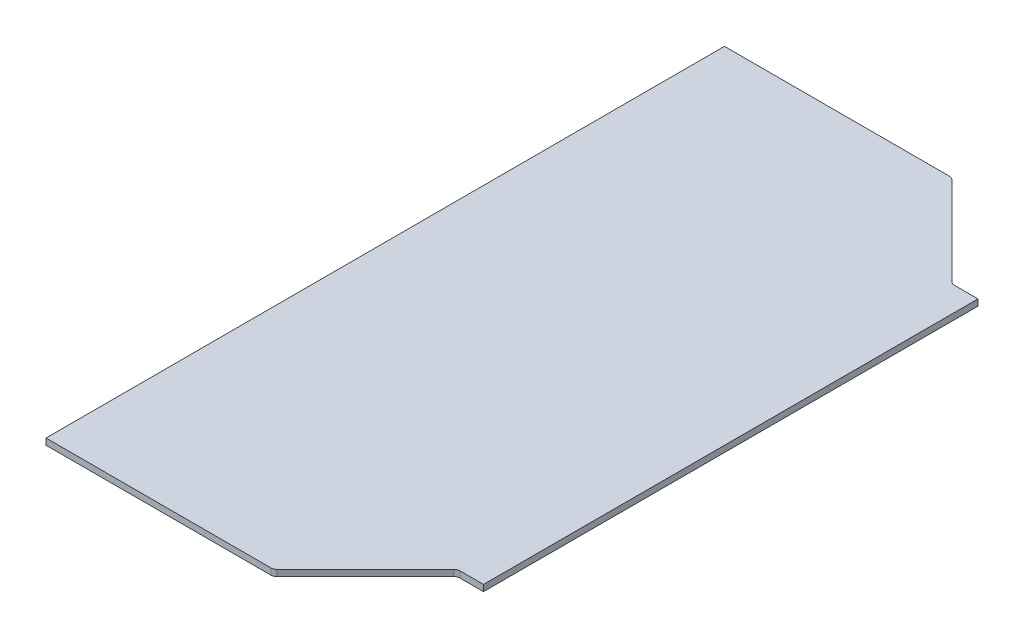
ISO-10303-21;
HEADER;
FILE_DESCRIPTION(('STEP AP214'),'2;1');
FILE_NAME('part.step','',(''),(''),'','','');
FILE_SCHEMA(('AUTOMOTIVE_DESIGN { 1 0 10303 214 1 1 1 1 }'));
ENDSEC;
DATA;
#1=APPLICATION_CONTEXT('core data for automotive mechanical design processes');
#2=APPLICATION_PROTOCOL_DEFINITION('international standard','automotive_design',2000,#1);
#3=PRODUCT_CONTEXT('',#1,'mechanical');
#4=PRODUCT('Part','Part','',(#3));
#5=PRODUCT_RELATED_PRODUCT_CATEGORY('part','',(#4));
#6=PRODUCT_DEFINITION_FORMATION('','',#4);
#7=PRODUCT_DEFINITION_CONTEXT('part definition',#1,'design');
#8=PRODUCT_DEFINITION('design','',#6,#7);
#9=PRODUCT_DEFINITION_SHAPE('','',#8);
#10=(LENGTH_UNIT() NAMED_UNIT(*) SI_UNIT(.MILLI.,.METRE.));
#11=(NAMED_UNIT(*) PLANE_ANGLE_UNIT() SI_UNIT($,.RADIAN.));
#12=(NAMED_UNIT(*) SI_UNIT($,.STERADIAN.) SOLID_ANGLE_UNIT());
#13=UNCERTAINTY_MEASURE_WITH_UNIT(LENGTH_MEASURE(1.E-05),#10,'distance_accuracy_value','');
#14=(GEOMETRIC_REPRESENTATION_CONTEXT(3) GLOBAL_UNCERTAINTY_ASSIGNED_CONTEXT((#13)) GLOBAL_UNIT_ASSIGNED_CONTEXT((#10,
#11,#12)) REPRESENTATION_CONTEXT('',''));
#15=CARTESIAN_POINT('',(0.,0.,0.));
#16=DIRECTION('',(0.,0.,1.));
#17=DIRECTION('',(1.,0.,0.));
#18=AXIS2_PLACEMENT_3D('',#15,#16,#17);
#19=CARTESIAN_POINT('',(0.,-12.7,0.));
#20=DIRECTION('',(-1.,0.,0.));
#21=DIRECTION('',(0.,0.,1.));
#22=AXIS2_PLACEMENT_3D('',#19,#20,#21);
#23=PLANE('',#22);
#24=DIRECTION('',(0.,0.,1.));
#25=VECTOR('',#24,1.);
#26=CARTESIAN_POINT('',(0.,0.,0.));
#27=LINE('',#26,#25);
#28=CARTESIAN_POINT('',(0.,0.,-1371.6));
#29=VERTEX_POINT('',#28);
#30=CARTESIAN_POINT('',(0.,0.,0.));
#31=VERTEX_POINT('',#30);
#32=EDGE_CURVE('E143',#29,#31,#27,.T.);
#33=ORIENTED_EDGE('',*,*,#32,.F.);
#34=DIRECTION('',(0.,1.,0.));
#35=VECTOR('',#34,1.);
#36=CARTESIAN_POINT('',(0.,-12.7,-1371.6));
#37=LINE('',#36,#35);
#38=CARTESIAN_POINT('',(0.,-12.7,-1371.6));
#39=VERTEX_POINT('',#38);
#40=EDGE_CURVE('E169',#39,#29,#37,.T.);
#41=ORIENTED_EDGE('',*,*,#40,.F.);
#42=DIRECTION('',(0.,0.,1.));
#43=VECTOR('',#42,1.);
#44=CARTESIAN_POINT('',(0.,-12.7,0.));
#45=LINE('',#44,#43);
#46=CARTESIAN_POINT('',(0.,-12.7,0.));
#47=VERTEX_POINT('',#46);
#48=EDGE_CURVE('E153',#39,#47,#45,.T.);
#49=ORIENTED_EDGE('',*,*,#48,.T.);
#50=DIRECTION('',(0.,1.,0.));
#51=VECTOR('',#50,1.);
#52=CARTESIAN_POINT('',(0.,-12.7,0.));
#53=LINE('',#52,#51);
#54=EDGE_CURVE('E162',#47,#31,#53,.T.);
#55=ORIENTED_EDGE('',*,*,#54,.T.);
#56=EDGE_LOOP('',(#33,#41,#49,#55));
#57=FACE_BOUND('',#56,.T.);
#58=ADVANCED_FACE('F30',(#57),#23,.T.);
#59=CARTESIAN_POINT('',(0.,-12.7,-1371.6));
#60=DIRECTION('',(0.,0.,-1.));
#61=DIRECTION('',(-1.,0.,0.));
#62=AXIS2_PLACEMENT_3D('',#59,#60,#61);
#63=PLANE('',#62);
#64=DIRECTION('',(-1.,0.,0.));
#65=VECTOR('',#64,1.);
#66=CARTESIAN_POINT('',(0.,0.,-1371.6));
#67=LINE('',#66,#65);
#68=CARTESIAN_POINT('',(454.479487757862,0.,-1371.6));
#69=VERTEX_POINT('',#68);
#70=EDGE_CURVE('E157',#69,#29,#67,.T.);
#71=ORIENTED_EDGE('',*,*,#70,.F.);
#72=DIRECTION('',(0.,1.,0.));
#73=VECTOR('',#72,1.);
#74=CARTESIAN_POINT('',(454.479487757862,-12.7,-1371.6));
#75=LINE('',#74,#73);
#76=CARTESIAN_POINT('',(454.479487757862,-12.7,-1371.6));
#77=VERTEX_POINT('',#76);
#78=EDGE_CURVE('E197',#69,#77,#75,.F.);
#79=ORIENTED_EDGE('',*,*,#78,.T.);
#80=DIRECTION('',(-1.,0.,0.));
#81=VECTOR('',#80,1.);
#82=CARTESIAN_POINT('',(0.,-12.7,-1371.6));
#83=LINE('',#82,#81);
#84=EDGE_CURVE('E160',#77,#39,#83,.T.);
#85=ORIENTED_EDGE('',*,*,#84,.T.);
#86=ORIENTED_EDGE('',*,*,#40,.T.);
#87=EDGE_LOOP('',(#71,#79,#85,#86));
#88=FACE_BOUND('',#87,.T.);
#89=ADVANCED_FACE('F248',(#88),#63,.T.);
#90=CARTESIAN_POINT('',(0.,-12.7,0.));
#91=DIRECTION('',(0.,0.,1.));
#92=DIRECTION('',(1.,0.,0.));
#93=AXIS2_PLACEMENT_3D('',#90,#91,#92);
#94=PLANE('',#93);
#95=DIRECTION('',(1.,0.,0.));
#96=VECTOR('',#95,1.);
#97=CARTESIAN_POINT('',(0.,-12.7,0.));
#98=LINE('',#97,#96);
#99=CARTESIAN_POINT('',(454.479487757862,-12.7,0.));
#100=VERTEX_POINT('',#99);
#101=EDGE_CURVE('E156',#47,#100,#98,.T.);
#102=ORIENTED_EDGE('',*,*,#101,.T.);
#103=DIRECTION('',(0.,1.,0.));
#104=VECTOR('',#103,1.);
#105=CARTESIAN_POINT('',(454.479487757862,0.,0.));
#106=LINE('',#105,#104);
#107=CARTESIAN_POINT('',(454.479487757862,0.,0.));
#108=VERTEX_POINT('',#107);
#109=EDGE_CURVE('E172',#100,#108,#106,.T.);
#110=ORIENTED_EDGE('',*,*,#109,.T.);
#111=DIRECTION('',(1.,0.,0.));
#112=VECTOR('',#111,1.);
#113=CARTESIAN_POINT('',(0.,0.,0.));
#114=LINE('',#113,#112);
#115=EDGE_CURVE('E165',#31,#108,#114,.T.);
#116=ORIENTED_EDGE('',*,*,#115,.F.);
#117=ORIENTED_EDGE('',*,*,#54,.F.);
#118=EDGE_LOOP('',(#102,#110,#116,#117));
#119=FACE_BOUND('',#118,.T.);
#120=ADVANCED_FACE('F237',(#119),#94,.T.);
#121=CARTESIAN_POINT('',(0.,-12.7,-1371.6));
#122=DIRECTION('',(0.,-1.,0.));
#123=DIRECTION('',(0.,0.,-1.));
#124=AXIS2_PLACEMENT_3D('',#121,#122,#123);
#125=PLANE('',#124);
#126=DIRECTION('',(0.,0.,-1.));
#127=VECTOR('',#126,1.);
#128=CARTESIAN_POINT('',(698.5,-12.7,-138.355105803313));
#129=LINE('',#128,#127);
#130=CARTESIAN_POINT('',(698.5,-12.7,-185.928));
#131=VERTEX_POINT('',#130);
#132=CARTESIAN_POINT('',(698.5,-12.7,-1185.672));
#133=VERTEX_POINT('',#132);
#134=EDGE_CURVE('E45',#131,#133,#129,.T.);
#135=ORIENTED_EDGE('',*,*,#134,.F.);
#136=DIRECTION('',(-1.,0.,0.));
#137=VECTOR('',#136,1.);
#138=CARTESIAN_POINT('',(645.667999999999,-12.7,-185.928));
#139=LINE('',#138,#137);
#140=CARTESIAN_POINT('',(650.928512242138,-12.7,-185.928));
#141=VERTEX_POINT('',#140);
#142=EDGE_CURVE('E130',#131,#141,#139,.T.);
#143=ORIENTED_EDGE('',*,*,#142,.T.);
#144=CARTESIAN_POINT('',(650.928512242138,-12.7,-173.228));
#145=DIRECTION('',(0.,-1.,0.));
#146=DIRECTION('',(0.,0.,-1.));
#147=AXIS2_PLACEMENT_3D('',#144,#145,#146);
#148=CIRCLE('',#147,12.7);
#149=CARTESIAN_POINT('',(641.948256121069,-12.7,-182.208256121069));
#150=VERTEX_POINT('',#149);
#151=EDGE_CURVE('E202',#141,#150,#148,.F.);
#152=ORIENTED_EDGE('',*,*,#151,.T.);
#153=DIRECTION('',(-0.707106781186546,0.,0.707106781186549));
#154=VECTOR('',#153,1.);
#155=CARTESIAN_POINT('',(459.74,-12.7,0.));
#156=LINE('',#155,#154);
#157=CARTESIAN_POINT('',(463.459743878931,-12.7,-3.71974387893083));
#158=VERTEX_POINT('',#157);
#159=EDGE_CURVE('E139',#150,#158,#156,.T.);
#160=ORIENTED_EDGE('',*,*,#159,.T.);
#161=CARTESIAN_POINT('',(454.479487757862,-12.7,-12.7));
#162=DIRECTION('',(0.,-1.,0.));
#163=DIRECTION('',(0.,0.,-1.));
#164=AXIS2_PLACEMENT_3D('',#161,#162,#163);
#165=CIRCLE('',#164,12.7);
#166=EDGE_CURVE('E187',#158,#100,#165,.T.);
#167=ORIENTED_EDGE('',*,*,#166,.T.);
#168=ORIENTED_EDGE('',*,*,#101,.F.);
#169=ORIENTED_EDGE('',*,*,#48,.F.);
#170=ORIENTED_EDGE('',*,*,#84,.F.);
#171=CARTESIAN_POINT('',(454.479487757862,-12.7,-1358.9));
#172=DIRECTION('',(0.,-1.,0.));
#173=DIRECTION('',(0.,0.,-1.));
#174=AXIS2_PLACEMENT_3D('',#171,#172,#173);
#175=CIRCLE('',#174,12.7);
#176=CARTESIAN_POINT('',(463.459743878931,-12.7,-1367.88025612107));
#177=VERTEX_POINT('',#176);
#178=EDGE_CURVE('E185',#77,#177,#175,.T.);
#179=ORIENTED_EDGE('',*,*,#178,.T.);
#180=DIRECTION('',(0.707106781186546,0.,0.707106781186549));
#181=VECTOR('',#180,1.);
#182=CARTESIAN_POINT('',(459.74,-12.7,-1371.6));
#183=LINE('',#182,#181);
#184=CARTESIAN_POINT('',(641.948256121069,-12.7,-1189.39174387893));
#185=VERTEX_POINT('',#184);
#186=EDGE_CURVE('E206',#177,#185,#183,.T.);
#187=ORIENTED_EDGE('',*,*,#186,.T.);
#188=CARTESIAN_POINT('',(650.928512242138,-12.7,-1198.372));
#189=DIRECTION('',(0.,-1.,0.));
#190=DIRECTION('',(0.,0.,-1.));
#191=AXIS2_PLACEMENT_3D('',#188,#189,#190);
#192=CIRCLE('',#191,12.7);
#193=CARTESIAN_POINT('',(650.928512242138,-12.7,-1185.672));
#194=VERTEX_POINT('',#193);
#195=EDGE_CURVE('E38',#185,#194,#192,.F.);
#196=ORIENTED_EDGE('',*,*,#195,.T.);
#197=DIRECTION('',(1.,0.,0.));
#198=VECTOR('',#197,1.);
#199=CARTESIAN_POINT('',(645.667999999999,-12.7,-1185.672));
#200=LINE('',#199,#198);
#201=EDGE_CURVE('E133',#194,#133,#200,.T.);
#202=ORIENTED_EDGE('',*,*,#201,.T.);
#203=EDGE_LOOP('',(#135,#143,#152,#160,#167,#168,#169,#170,#179,#187,#196,#202));
#204=FACE_BOUND('',#203,.T.);
#205=ADVANCED_FACE('F129',(#204),#125,.T.);
#206=CARTESIAN_POINT('',(0.,0.,-1371.6));
#207=DIRECTION('',(0.,-1.,0.));
#208=DIRECTION('',(0.,0.,-1.));
#209=AXIS2_PLACEMENT_3D('',#206,#207,#208);
#210=PLANE('',#209);
#211=DIRECTION('',(-1.,0.,0.));
#212=VECTOR('',#211,1.);
#213=CARTESIAN_POINT('',(645.667999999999,0.,-185.928));
#214=LINE('',#213,#212);
#215=CARTESIAN_POINT('',(698.5,0.,-185.928));
#216=VERTEX_POINT('',#215);
#217=CARTESIAN_POINT('',(650.928512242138,0.,-185.928));
#218=VERTEX_POINT('',#217);
#219=EDGE_CURVE('E146',#216,#218,#214,.T.);
#220=ORIENTED_EDGE('',*,*,#219,.F.);
#221=DIRECTION('',(0.,0.,-1.));
#222=VECTOR('',#221,1.);
#223=CARTESIAN_POINT('',(698.5,0.,-138.355105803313));
#224=LINE('',#223,#222);
#225=CARTESIAN_POINT('',(698.5,0.,-1185.672));
#226=VERTEX_POINT('',#225);
#227=EDGE_CURVE('E121',#216,#226,#224,.T.);
#228=ORIENTED_EDGE('',*,*,#227,.T.);
#229=DIRECTION('',(1.,0.,0.));
#230=VECTOR('',#229,1.);
#231=CARTESIAN_POINT('',(645.667999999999,0.,-1185.672));
#232=LINE('',#231,#230);
#233=CARTESIAN_POINT('',(650.928512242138,0.,-1185.672));
#234=VERTEX_POINT('',#233);
#235=EDGE_CURVE('E149',#234,#226,#232,.T.);
#236=ORIENTED_EDGE('',*,*,#235,.F.);
#237=CARTESIAN_POINT('',(650.928512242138,0.,-1198.372));
#238=DIRECTION('',(0.,-1.,0.));
#239=DIRECTION('',(0.,0.,-1.));
#240=AXIS2_PLACEMENT_3D('',#237,#238,#239);
#241=CIRCLE('',#240,12.7);
#242=CARTESIAN_POINT('',(641.948256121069,0.,-1189.39174387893));
#243=VERTEX_POINT('',#242);
#244=EDGE_CURVE('E204',#234,#243,#241,.T.);
#245=ORIENTED_EDGE('',*,*,#244,.T.);
#246=DIRECTION('',(0.707106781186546,0.,0.707106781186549));
#247=VECTOR('',#246,1.);
#248=CARTESIAN_POINT('',(459.74,0.,-1371.6));
#249=LINE('',#248,#247);
#250=CARTESIAN_POINT('',(463.459743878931,0.,-1367.88025612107));
#251=VERTEX_POINT('',#250);
#252=EDGE_CURVE('E125',#251,#243,#249,.T.);
#253=ORIENTED_EDGE('',*,*,#252,.F.);
#254=CARTESIAN_POINT('',(454.479487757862,0.,-1358.9));
#255=DIRECTION('',(0.,-1.,0.));
#256=DIRECTION('',(0.,0.,-1.));
#257=AXIS2_PLACEMENT_3D('',#254,#255,#256);
#258=CIRCLE('',#257,12.7);
#259=EDGE_CURVE('E176',#251,#69,#258,.F.);
#260=ORIENTED_EDGE('',*,*,#259,.T.);
#261=ORIENTED_EDGE('',*,*,#70,.T.);
#262=ORIENTED_EDGE('',*,*,#32,.T.);
#263=ORIENTED_EDGE('',*,*,#115,.T.);
#264=CARTESIAN_POINT('',(454.479487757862,0.,-12.7));
#265=DIRECTION('',(0.,-1.,0.));
#266=DIRECTION('',(0.,0.,-1.));
#267=AXIS2_PLACEMENT_3D('',#264,#265,#266);
#268=CIRCLE('',#267,12.7);
#269=CARTESIAN_POINT('',(463.459743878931,0.,-3.71974387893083));
#270=VERTEX_POINT('',#269);
#271=EDGE_CURVE('E178',#108,#270,#268,.F.);
#272=ORIENTED_EDGE('',*,*,#271,.T.);
#273=DIRECTION('',(-0.707106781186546,0.,0.707106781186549));
#274=VECTOR('',#273,1.);
#275=CARTESIAN_POINT('',(459.74,0.,0.));
#276=LINE('',#275,#274);
#277=CARTESIAN_POINT('',(641.948256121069,0.,-182.208256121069));
#278=VERTEX_POINT('',#277);
#279=EDGE_CURVE('E140',#278,#270,#276,.T.);
#280=ORIENTED_EDGE('',*,*,#279,.F.);
#281=CARTESIAN_POINT('',(650.928512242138,0.,-173.228));
#282=DIRECTION('',(0.,-1.,0.));
#283=DIRECTION('',(0.,0.,-1.));
#284=AXIS2_PLACEMENT_3D('',#281,#282,#283);
#285=CIRCLE('',#284,12.7);
#286=EDGE_CURVE('E199',#278,#218,#285,.T.);
#287=ORIENTED_EDGE('',*,*,#286,.T.);
#288=EDGE_LOOP('',(#220,#228,#236,#245,#253,#260,#261,#262,#263,#272,#280,#287));
#289=FACE_BOUND('',#288,.T.);
#290=ADVANCED_FACE('F217',(#289),#210,.F.);
#291=CARTESIAN_POINT('',(459.74,-12.7,0.));
#292=DIRECTION('',(-0.707106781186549,0.,-0.707106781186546));
#293=DIRECTION('',(-0.707106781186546,0.,0.707106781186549));
#294=AXIS2_PLACEMENT_3D('',#291,#292,#293);
#295=PLANE('',#294);
#296=ORIENTED_EDGE('',*,*,#279,.T.);
#297=DIRECTION('',(0.,1.,0.));
#298=VECTOR('',#297,1.);
#299=CARTESIAN_POINT('',(463.459743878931,-12.7,-3.71974387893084));
#300=LINE('',#299,#298);
#301=EDGE_CURVE('E183',#270,#158,#300,.F.);
#302=ORIENTED_EDGE('',*,*,#301,.T.);
#303=ORIENTED_EDGE('',*,*,#159,.F.);
#304=DIRECTION('',(0.,1.,0.));
#305=VECTOR('',#304,1.);
#306=CARTESIAN_POINT('',(641.948256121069,0.,-182.208256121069));
#307=LINE('',#306,#305);
#308=EDGE_CURVE('E180',#150,#278,#307,.T.);
#309=ORIENTED_EDGE('',*,*,#308,.T.);
#310=EDGE_LOOP('',(#296,#302,#303,#309));
#311=FACE_BOUND('',#310,.T.);
#312=ADVANCED_FACE('F229',(#311),#295,.F.);
#313=CARTESIAN_POINT('',(645.667999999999,-12.7,-185.928));
#314=DIRECTION('',(0.,0.,-1.));
#315=DIRECTION('',(-1.,0.,0.));
#316=AXIS2_PLACEMENT_3D('',#313,#314,#315);
#317=PLANE('',#316);
#318=ORIENTED_EDGE('',*,*,#142,.F.);
#319=DIRECTION('',(0.,1.,0.));
#320=VECTOR('',#319,1.);
#321=CARTESIAN_POINT('',(698.5,-12.7,-185.928));
#322=LINE('',#321,#320);
#323=EDGE_CURVE('E118',#131,#216,#322,.T.);
#324=ORIENTED_EDGE('',*,*,#323,.T.);
#325=ORIENTED_EDGE('',*,*,#219,.T.);
#326=DIRECTION('',(0.,1.,0.));
#327=VECTOR('',#326,1.);
#328=CARTESIAN_POINT('',(650.928512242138,-12.7,-185.928));
#329=LINE('',#328,#327);
#330=EDGE_CURVE('E137',#218,#141,#329,.F.);
#331=ORIENTED_EDGE('',*,*,#330,.T.);
#332=EDGE_LOOP('',(#318,#324,#325,#331));
#333=FACE_BOUND('',#332,.T.);
#334=ADVANCED_FACE('F135',(#333),#317,.F.);
#335=CARTESIAN_POINT('',(645.667999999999,-12.7,-1185.672));
#336=DIRECTION('',(0.,0.,1.));
#337=DIRECTION('',(1.,0.,0.));
#338=AXIS2_PLACEMENT_3D('',#335,#336,#337);
#339=PLANE('',#338);
#340=ORIENTED_EDGE('',*,*,#235,.T.);
#341=DIRECTION('',(0.,-1.,0.));
#342=VECTOR('',#341,1.);
#343=CARTESIAN_POINT('',(698.5,-12.7,-1185.672));
#344=LINE('',#343,#342);
#345=EDGE_CURVE('E11',#226,#133,#344,.T.);
#346=ORIENTED_EDGE('',*,*,#345,.T.);
#347=ORIENTED_EDGE('',*,*,#201,.F.);
#348=DIRECTION('',(0.,1.,0.));
#349=VECTOR('',#348,1.);
#350=CARTESIAN_POINT('',(650.928512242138,0.,-1185.672));
#351=LINE('',#350,#349);
#352=EDGE_CURVE('E190',#194,#234,#351,.T.);
#353=ORIENTED_EDGE('',*,*,#352,.T.);
#354=EDGE_LOOP('',(#340,#346,#347,#353));
#355=FACE_BOUND('',#354,.T.);
#356=ADVANCED_FACE('F211',(#355),#339,.F.);
#357=CARTESIAN_POINT('',(459.74,-12.7,-1371.6));
#358=DIRECTION('',(-0.707106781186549,0.,0.707106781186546));
#359=DIRECTION('',(0.707106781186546,0.,0.707106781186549));
#360=AXIS2_PLACEMENT_3D('',#357,#358,#359);
#361=PLANE('',#360);
#362=ORIENTED_EDGE('',*,*,#252,.T.);
#363=DIRECTION('',(0.,1.,0.));
#364=VECTOR('',#363,1.);
#365=CARTESIAN_POINT('',(641.948256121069,-12.7,-1189.39174387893));
#366=LINE('',#365,#364);
#367=EDGE_CURVE('E52',#243,#185,#366,.F.);
#368=ORIENTED_EDGE('',*,*,#367,.T.);
#369=ORIENTED_EDGE('',*,*,#186,.F.);
#370=DIRECTION('',(0.,1.,0.));
#371=VECTOR('',#370,1.);
#372=CARTESIAN_POINT('',(463.459743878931,0.,-1367.88025612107));
#373=LINE('',#372,#371);
#374=EDGE_CURVE('E193',#177,#251,#373,.T.);
#375=ORIENTED_EDGE('',*,*,#374,.T.);
#376=EDGE_LOOP('',(#362,#368,#369,#375));
#377=FACE_BOUND('',#376,.T.);
#378=ADVANCED_FACE('F218',(#377),#361,.F.);
#379=CARTESIAN_POINT('',(454.479487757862,-12.7,-12.7));
#380=DIRECTION('',(0.,-1.,0.));
#381=DIRECTION('',(0.,0.,-1.));
#382=AXIS2_PLACEMENT_3D('',#379,#380,#381);
#383=CYLINDRICAL_SURFACE('',#382,12.7);
#384=ORIENTED_EDGE('',*,*,#166,.F.);
#385=ORIENTED_EDGE('',*,*,#301,.F.);
#386=ORIENTED_EDGE('',*,*,#271,.F.);
#387=ORIENTED_EDGE('',*,*,#109,.F.);
#388=EDGE_LOOP('',(#384,#385,#386,#387));
#389=FACE_BOUND('',#388,.T.);
#390=ADVANCED_FACE('F232',(#389),#383,.T.);
#391=CARTESIAN_POINT('',(650.928512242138,-12.7,-173.228));
#392=DIRECTION('',(0.,-1.,0.));
#393=DIRECTION('',(0.,0.,-1.));
#394=AXIS2_PLACEMENT_3D('',#391,#392,#393);
#395=CYLINDRICAL_SURFACE('',#394,12.7);
#396=ORIENTED_EDGE('',*,*,#151,.F.);
#397=ORIENTED_EDGE('',*,*,#330,.F.);
#398=ORIENTED_EDGE('',*,*,#286,.F.);
#399=ORIENTED_EDGE('',*,*,#308,.F.);
#400=EDGE_LOOP('',(#396,#397,#398,#399));
#401=FACE_BOUND('',#400,.T.);
#402=ADVANCED_FACE('F225',(#401),#395,.F.);
#403=CARTESIAN_POINT('',(650.928512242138,-12.7,-1198.372));
#404=DIRECTION('',(0.,-1.,0.));
#405=DIRECTION('',(0.,0.,-1.));
#406=AXIS2_PLACEMENT_3D('',#403,#404,#405);
#407=CYLINDRICAL_SURFACE('',#406,12.7);
#408=ORIENTED_EDGE('',*,*,#195,.F.);
#409=ORIENTED_EDGE('',*,*,#367,.F.);
#410=ORIENTED_EDGE('',*,*,#244,.F.);
#411=ORIENTED_EDGE('',*,*,#352,.F.);
#412=EDGE_LOOP('',(#408,#409,#410,#411));
#413=FACE_BOUND('',#412,.T.);
#414=ADVANCED_FACE('F214',(#413),#407,.F.);
#415=CARTESIAN_POINT('',(454.479487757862,-12.7,-1358.9));
#416=DIRECTION('',(0.,-1.,0.));
#417=DIRECTION('',(0.,0.,-1.));
#418=AXIS2_PLACEMENT_3D('',#415,#416,#417);
#419=CYLINDRICAL_SURFACE('',#418,12.7);
#420=ORIENTED_EDGE('',*,*,#178,.F.);
#421=ORIENTED_EDGE('',*,*,#78,.F.);
#422=ORIENTED_EDGE('',*,*,#259,.F.);
#423=ORIENTED_EDGE('',*,*,#374,.F.);
#424=EDGE_LOOP('',(#420,#421,#422,#423));
#425=FACE_BOUND('',#424,.T.);
#426=ADVANCED_FACE('F32',(#425),#419,.T.);
#427=CARTESIAN_POINT('',(698.5,0.,-138.355105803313));
#428=DIRECTION('',(-1.,0.,0.));
#429=DIRECTION('',(0.,0.,1.));
#430=AXIS2_PLACEMENT_3D('',#427,#428,#429);
#431=PLANE('',#430);
#432=ORIENTED_EDGE('',*,*,#134,.T.);
#433=ORIENTED_EDGE('',*,*,#345,.F.);
#434=ORIENTED_EDGE('',*,*,#227,.F.);
#435=ORIENTED_EDGE('',*,*,#323,.F.);
#436=EDGE_LOOP('',(#432,#433,#434,#435));
#437=FACE_BOUND('',#436,.T.);
#438=ADVANCED_FACE('F119',(#437),#431,.F.);
#439=CLOSED_SHELL('',(#58,#89,#120,#205,#290,#312,#334,#356,#378,#390,#402,#414,#426,#438));
#440=MANIFOLD_SOLID_BREP('B2',#439);
#441=ADVANCED_BREP_SHAPE_REPRESENTATION('',(#18,#440),#14);
#442=SHAPE_DEFINITION_REPRESENTATION(#9,#441);
ENDSEC;
END-ISO-10303-21;
